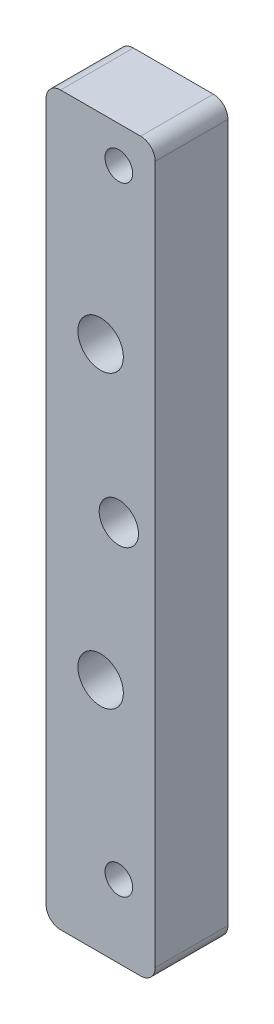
from build123d import *

# Parameters (mm, degrees)
SKETCH1_W           = 19.05
SKETCH1_H           = 127
BOSS_EXTRUDE1_DEPTH = 12.7
SKETCH2_R           = 2.413
SKETCH2_R_2         = 3.429
CUT_EXTRUDE1_DEPTH  = 75.190903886
SKETCH3_R           = 3.96875
CUT_EXTRUDE2_DEPTH  = 75.190903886
FILLET1_R           = 2.54


with BuildPart() as part:
    # Sketch1 → Boss-Extrude1 (new body)
    with BuildSketch(Plane.XY):
        with Locations((1.83566035, -8.707586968)):
            Rectangle(SKETCH1_W, SKETCH1_H)
    extrude(amount=BOSS_EXTRUDE1_DEPTH)

    # Sketch2 → Cut-Extrude1 (cut, through all)
    with BuildSketch(Plane.XY.offset(12.7)):
        with Locations((5.01066035, 48.442413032)):
            Circle(SKETCH2_R)
        with Locations((5.01066035, -59.507586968)):
            Circle(SKETCH2_R)
        with Locations((5.01066035, -5.532586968)):
            Circle(SKETCH2_R_2)
    extrude(amount=-CUT_EXTRUDE1_DEPTH, mode=Mode.SUBTRACT)

    # Sketch3 → Cut-Extrude2 (cut, through all)
    with BuildSketch(Plane.XY.offset(12.7)):
        with Locations((1.83566035, 19.867413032)):
            Circle(SKETCH3_R)
        with Locations((1.83566035, -30.932586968)):
            Circle(SKETCH3_R)
    extrude(amount=-CUT_EXTRUDE2_DEPTH, mode=Mode.SUBTRACT)

    # Fillet1
    fillet1_edges = [part.edges().sort_by_distance(p)[0] for p in [
        (-7.68933965, 54.792413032, 6.35),
        (11.36066035, 54.792413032, 6.35),
        (11.36066035, -72.207586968, 6.35),
        (-7.68933965, -72.207586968, 6.35),
    ]]
    fillet(fillet1_edges, radius=FILLET1_R)


solid = part.part
